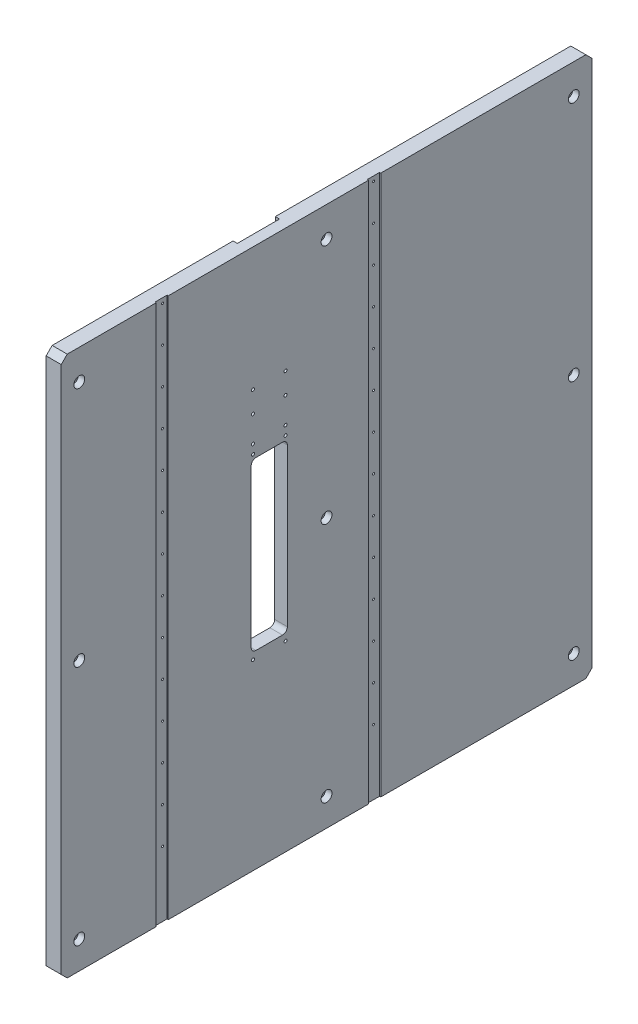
from build123d import *

# Parameters (mm, degrees)
ESQUISSE1_W                                        = 880
ESQUISSE1_H                                        = 896
BOSS_EXTRU_1_DEPTH                                 = 25
ESQUISSE17_W                                       = 20
ESQUISSE17_H                                       = 896
ENL_V_MAT_EXTRU_6_DEPTH                            = 2
TROU_TARAUD_M44_D                                  = 3.3
R_P_TITION_LIN_AIRE5_COUNT                         = 14
R_P_TITION_LIN_AIRE5_PITCH                         = 60
CHAMBRAGE_POUR_VIS_T_TE_HEXAGONALE_M10_D           = 11
CHAMBRAGE_POUR_VIS_T_TE_HEXAGONALE_M10_CBORE_D     = 18
CHAMBRAGE_POUR_VIS_T_TE_HEXAGONALE_M10_CBORE_DEPTH = 10.6
ENL_V_MAT_EXTRU_7_DEPTH                            = 4
TROU_TARAUD_M61_D                                  = 5
TROU_TARAUD_M31_AT_2_COUNT                         = 2
TROU_TARAUD_M31_AT_2_PITCH                         = 35
TROU_TARAUD_M31_AT_3_COUNT                         = 2
TROU_TARAUD_M31_AT_3_PITCH                         = 187
TROU_TARAUD_M31_AT_4_COUNT                         = 2
TROU_TARAUD_M31_AT_4_PITCH                         = 222
R_P_TITION_LIN_AIRE6_COUNT                         = 3
R_P_TITION_LIN_AIRE6_PITCH                         = 5
ENL_V_MAT_EXTRU_8_DEPTH                            = 3
CHANFREIN1_SIZE                                    = 10


with BuildPart() as part:
    # Esquisse1 → Boss.-Extru.1 (new body)
    with BuildSketch(Plane(origin=(0, 0, 0), x_dir=(0, 0, -1), z_dir=(1, 0, 0))):
        with Locations((0, 448)):
            Rectangle(ESQUISSE1_W, ESQUISSE1_H)
        with BuildLine():
            Line((-117, 591), (-73, 591))
            ThreePointArc((-73, 591), (-67.343145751, 588.656854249), (-65, 583))
            Line((-65, 583), (-65, 322))
            ThreePointArc((-65, 322), (-67.343145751, 316.343145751), (-73, 314))
            Line((-73, 314), (-117, 314))
            ThreePointArc((-117, 314), (-122.656854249, 316.343145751), (-125, 322))
            Line((-125, 322), (-125, 583))
            ThreePointArc((-125, 583), (-122.656854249, 588.656854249), (-117, 591))
        make_face(mode=Mode.SUBTRACT)
    extrude(amount=-BOSS_EXTRU_1_DEPTH)

    # Esquisse17 → Enl_v. mat.-Extru.6 (cut)
    with BuildSketch(Plane.ZY):
        with Locations((-80, 448)):
            Rectangle(ESQUISSE17_W, ESQUISSE17_H)
        with Locations((272.5, 448)):
            Rectangle(ESQUISSE17_W, ESQUISSE17_H)
    extrude(amount=ENL_V_MAT_EXTRU_6_DEPTH, mode=Mode.SUBTRACT)

    # Trou taraud_ M44 (through all)
    with Locations(Plane(origin=(-2, 0, 0), x_dir=(0, 0, -1), z_dir=(1, 0, 0))):
        with Locations((80, 888), (-270, 888)):
            trou_taraud_m44 = Hole(TROU_TARAUD_M44_D / 2)

    # R_p_tition lin_aire5: Trou taraud_ M44 ×14
    with Locations(*[(0, -i * R_P_TITION_LIN_AIRE5_PITCH, 0) for i in range(1, R_P_TITION_LIN_AIRE5_COUNT)]):
        add(trou_taraud_m44, mode=Mode.SUBTRACT)

    # Chambrage pour vis _ t_te hexagonale M10 (through all)
    with Locations(Plane(origin=(0, 0, 0), x_dir=(0, 0, -1), z_dir=(1, 0, 0))):
        with Locations((-410, 846), (410, 846), (410, 46), (-410, 46), (410, 446), (-410, 446), (0, 846), (0, 446), (0, 46)):
            CounterBoreHole(CHAMBRAGE_POUR_VIS_T_TE_HEXAGONALE_M10_D / 2, CHAMBRAGE_POUR_VIS_T_TE_HEXAGONALE_M10_CBORE_D / 2, CHAMBRAGE_POUR_VIS_T_TE_HEXAGONALE_M10_CBORE_DEPTH)

    # Esquisse24 → Enl_v. mat.-Extru.7 (cut)
    with BuildSketch(Plane.ZY.offset(25)):
        with BuildLine():
            Line((60, 896), (130, 896))
            Line((130, 896), (130, 287))
            ThreePointArc((130, 287), (127.071067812, 279.928932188), (120, 277))
            Line((120, 277), (70, 277))
            ThreePointArc((70, 277), (62.928932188, 279.928932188), (60, 287))
            Line((60, 287), (60, 896))
        make_face()
    extrude(amount=-ENL_V_MAT_EXTRU_7_DEPTH, mode=Mode.SUBTRACT)

    # Trou taraud_ M61 (through all)
    with Locations(Plane.ZY.offset(21)):
        with Locations((68, 691), (68, 656), (68, 613), (68, 598), (68, 303), (122, 303), (122, 598), (122, 613), (122, 656), (122, 691)):
            Hole(TROU_TARAUD_M61_D / 2)

    # Esquisse28 → Trou taraud_ M31 (revolve, cut)
    with BuildSketch(Plane(origin=(-25, 568.5, 53), x_dir=(0, 0, 1), z_dir=(0, 1, 0))):
        Polygon((0, 0), (0, 8.251075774), (1.25, 7.5), (1.25, 0), align=None)
    trou_taraud_m31 = revolve(axis=Axis((-31.35, 568.5, 53), (1, 0, 0)), mode=Mode.SUBTRACT)

    # Trou taraud_ M31 at 2: Trou taraud_ M31 ×2
    with Locations(*[(0, -i * TROU_TARAUD_M31_AT_2_PITCH, 0) for i in range(1, TROU_TARAUD_M31_AT_2_COUNT)]):
        add(trou_taraud_m31, mode=Mode.SUBTRACT)

    # Trou taraud_ M31 at 3: Trou taraud_ M31 ×2
    with Locations(*[(0, -i * TROU_TARAUD_M31_AT_3_PITCH, 0) for i in range(1, TROU_TARAUD_M31_AT_3_COUNT)]):
        add(trou_taraud_m31, mode=Mode.SUBTRACT)

    # Trou taraud_ M31 at 4: Trou taraud_ M31 ×2
    with Locations(*[(0, -i * TROU_TARAUD_M31_AT_4_PITCH, 0) for i in range(1, TROU_TARAUD_M31_AT_4_COUNT)]):
        add(trou_taraud_m31, mode=Mode.SUBTRACT)

    # R_p_tition lin_aire6: Trou taraud_ M31 ×3
    with Locations(*[(0, -i * R_P_TITION_LIN_AIRE6_PITCH, 0) for i in range(1, R_P_TITION_LIN_AIRE6_COUNT)]):
        add(trou_taraud_m31, mode=Mode.SUBTRACT)

    # R_p_tition lin_aire6 copy 1 sketch → R_p_tition lin_aire6 copy 1 (revolve, cut)
    with BuildSketch(Plane(origin=(-25, 528.5, 53), x_dir=(0, 0, 1), z_dir=(0, 1, 0))):
        Polygon((0, 0), (0, 8.251075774), (1.25, 7.5), (1.25, 0), align=None)
    revolve(axis=Axis((-31.35, 528.5, 53), (1, 0, 0)), mode=Mode.SUBTRACT)

    # R_p_tition lin_aire6 copy 2 sketch → R_p_tition lin_aire6 copy 2 (revolve, cut)
    with BuildSketch(Plane(origin=(-25, 523.5, 53), x_dir=(0, 0, 1), z_dir=(0, 1, 0))):
        Polygon((0, 0), (0, 8.251075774), (1.25, 7.5), (1.25, 0), align=None)
    revolve(axis=Axis((-31.35, 523.5, 53), (1, 0, 0)), mode=Mode.SUBTRACT)

    # R_p_tition lin_aire6 copy 3 sketch → R_p_tition lin_aire6 copy 3 (revolve, cut)
    with BuildSketch(Plane(origin=(-25, 376.5, 53), x_dir=(0, 0, 1), z_dir=(0, 1, 0))):
        Polygon((0, 0), (0, 8.251075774), (1.25, 7.5), (1.25, 0), align=None)
    revolve(axis=Axis((-31.35, 376.5, 53), (1, 0, 0)), mode=Mode.SUBTRACT)

    # R_p_tition lin_aire6 copy 4 sketch → R_p_tition lin_aire6 copy 4 (revolve, cut)
    with BuildSketch(Plane(origin=(-25, 371.5, 53), x_dir=(0, 0, 1), z_dir=(0, 1, 0))):
        Polygon((0, 0), (0, 8.251075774), (1.25, 7.5), (1.25, 0), align=None)
    revolve(axis=Axis((-31.35, 371.5, 53), (1, 0, 0)), mode=Mode.SUBTRACT)

    # R_p_tition lin_aire6 copy 5 sketch → R_p_tition lin_aire6 copy 5 (revolve, cut)
    with BuildSketch(Plane(origin=(-25, 341.5, 53), x_dir=(0, 0, 1), z_dir=(0, 1, 0))):
        Polygon((0, 0), (0, 8.251075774), (1.25, 7.5), (1.25, 0), align=None)
    revolve(axis=Axis((-31.35, 341.5, 53), (1, 0, 0)), mode=Mode.SUBTRACT)

    # R_p_tition lin_aire6 copy 6 sketch → R_p_tition lin_aire6 copy 6 (revolve, cut)
    with BuildSketch(Plane(origin=(-25, 336.5, 53), x_dir=(0, 0, 1), z_dir=(0, 1, 0))):
        Polygon((0, 0), (0, 8.251075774), (1.25, 7.5), (1.25, 0), align=None)
    revolve(axis=Axis((-31.35, 336.5, 53), (1, 0, 0)), mode=Mode.SUBTRACT)

    # Esquisse29 → Enl_v. mat.-Extru.8 (cut)
    with BuildSketch(Plane.ZY.offset(21)):
        with BuildLine():
            Line((60, 896), (130, 896))
            Line((130, 896), (130, 721))
            ThreePointArc((130, 721), (127.071067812, 713.928932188), (120, 711))
            Line((120, 711), (70, 711))
            ThreePointArc((70, 711), (62.928932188, 713.928932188), (60, 721))
            Line((60, 721), (60, 896))
        make_face()
    extrude(amount=-ENL_V_MAT_EXTRU_8_DEPTH, mode=Mode.SUBTRACT)

    # Chanfrein1
    chanfrein1_edges = [part.edges().sort_by_distance(p)[0] for p in [
        (-12.5, 896, 440),
        (-12.5, 896, -440),
        (-12.5, 0, -440),
        (-12.5, 0, 440),
    ]]
    chamfer(chanfrein1_edges, length=CHANFREIN1_SIZE)


solid = part.part
